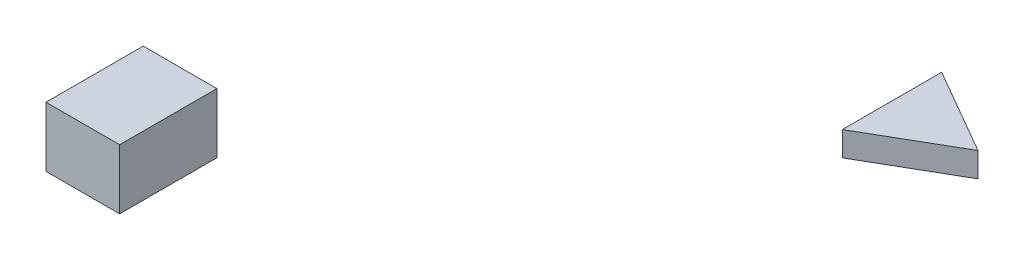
from build123d import *

# Parameters (mm, degrees)
EXTRUDE1_DEPTH = 12.7
SKETCH3_W      = 100.648267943
SKETCH3_H      = 62.006522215
EXTRUDE2_DEPTH = 38.1


with BuildPart() as part:
    # Sketch2 → Extrude1 (new, symmetric)
    with BuildSketch(Plane(origin=(0, 0, 0), x_dir=(1, 0, 0), z_dir=(0, 1, 0))):
        Polygon((381, 51.647185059), (381, -51.103653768), (469.984836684, 0.271765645), align=None)
    extrude(amount=EXTRUDE1_DEPTH, both=True)


with BuildPart() as body_2:
    # Sketch3 → Extrude2 (new, symmetric)
    with BuildSketch(Plane(origin=(0, 0, 0), x_dir=(0, 0, -1), z_dir=(1, 0, 0))):
        with Locations((-405.924133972, -0.803508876)):
            Rectangle(SKETCH3_W, SKETCH3_H)
    extrude(amount=EXTRUDE2_DEPTH, both=True)


solid = Compound([part.part, body_2.part])
